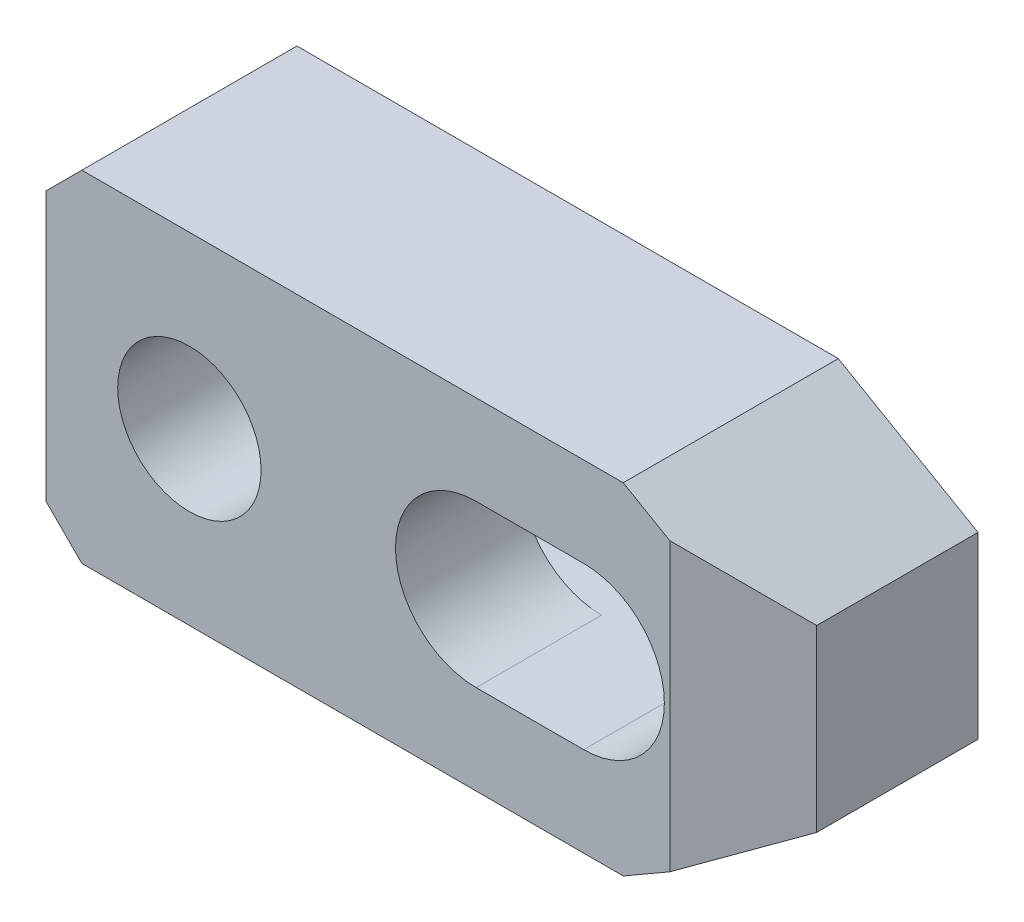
ISO-10303-21;
HEADER;
FILE_DESCRIPTION(('STEP AP214'),'2;1');
FILE_NAME('part.step','',(''),(''),'','','');
FILE_SCHEMA(('AUTOMOTIVE_DESIGN { 1 0 10303 214 1 1 1 1 }'));
ENDSEC;
DATA;
#1=APPLICATION_CONTEXT('core data for automotive mechanical design processes');
#2=APPLICATION_PROTOCOL_DEFINITION('international standard','automotive_design',2000,#1);
#3=PRODUCT_CONTEXT('',#1,'mechanical');
#4=PRODUCT('Part','Part','',(#3));
#5=PRODUCT_RELATED_PRODUCT_CATEGORY('part','',(#4));
#6=PRODUCT_DEFINITION_FORMATION('','',#4);
#7=PRODUCT_DEFINITION_CONTEXT('part definition',#1,'design');
#8=PRODUCT_DEFINITION('design','',#6,#7);
#9=PRODUCT_DEFINITION_SHAPE('','',#8);
#10=(LENGTH_UNIT() NAMED_UNIT(*) SI_UNIT(.MILLI.,.METRE.));
#11=(NAMED_UNIT(*) PLANE_ANGLE_UNIT() SI_UNIT($,.RADIAN.));
#12=(NAMED_UNIT(*) SI_UNIT($,.STERADIAN.) SOLID_ANGLE_UNIT());
#13=UNCERTAINTY_MEASURE_WITH_UNIT(LENGTH_MEASURE(1.E-05),#10,'distance_accuracy_value','');
#14=(GEOMETRIC_REPRESENTATION_CONTEXT(3) GLOBAL_UNCERTAINTY_ASSIGNED_CONTEXT((#13)) GLOBAL_UNIT_ASSIGNED_CONTEXT((#10,
#11,#12)) REPRESENTATION_CONTEXT('',''));
#15=CARTESIAN_POINT('',(0.,0.,0.));
#16=DIRECTION('',(0.,0.,1.));
#17=DIRECTION('',(1.,0.,0.));
#18=AXIS2_PLACEMENT_3D('',#15,#16,#17);
#19=CARTESIAN_POINT('',(-16.9439203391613,20.5560796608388,0.));
#20=DIRECTION('',(0.,0.,1.));
#21=DIRECTION('',(-1.,0.,0.));
#22=AXIS2_PLACEMENT_3D('',#19,#20,#21);
#23=PLANE('',#22);
#24=DIRECTION('',(0.,1.,0.));
#25=VECTOR('',#24,1.);
#26=CARTESIAN_POINT('',(-30.,-7.5,0.));
#27=LINE('',#26,#25);
#28=CARTESIAN_POINT('',(-30.,-7.5,0.));
#29=VERTEX_POINT('',#28);
#30=CARTESIAN_POINT('',(-30.,-4.5,0.));
#31=VERTEX_POINT('',#30);
#32=EDGE_CURVE('E147',#29,#31,#27,.T.);
#33=ORIENTED_EDGE('',*,*,#32,.T.);
#34=DIRECTION('',(-1.,0.,0.));
#35=VECTOR('',#34,1.);
#36=CARTESIAN_POINT('',(0.,-4.5,0.));
#37=LINE('',#36,#35);
#38=CARTESIAN_POINT('',(0.,-4.5,0.));
#39=VERTEX_POINT('',#38);
#40=EDGE_CURVE('E237',#39,#31,#37,.T.);
#41=ORIENTED_EDGE('',*,*,#40,.F.);
#42=CARTESIAN_POINT('',(0.,0.,0.));
#43=DIRECTION('',(0.,0.,1.));
#44=DIRECTION('',(-1.,0.,0.));
#45=AXIS2_PLACEMENT_3D('',#42,#43,#44);
#46=CIRCLE('',#45,4.5);
#47=CARTESIAN_POINT('',(0.,4.5,0.));
#48=VERTEX_POINT('',#47);
#49=EDGE_CURVE('E129',#39,#48,#46,.T.);
#50=ORIENTED_EDGE('',*,*,#49,.T.);
#51=DIRECTION('',(1.,0.,0.));
#52=VECTOR('',#51,1.);
#53=CARTESIAN_POINT('',(-6.,4.5,0.));
#54=LINE('',#53,#52);
#55=CARTESIAN_POINT('',(-30.,4.5,0.));
#56=VERTEX_POINT('',#55);
#57=EDGE_CURVE('E120',#56,#48,#54,.T.);
#58=ORIENTED_EDGE('',*,*,#57,.F.);
#59=CARTESIAN_POINT('',(-30.,7.5,0.));
#60=VERTEX_POINT('',#59);
#61=EDGE_CURVE('E125',#56,#60,#27,.T.);
#62=ORIENTED_EDGE('',*,*,#61,.T.);
#63=DIRECTION('',(-0.707106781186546,-0.70710678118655,0.));
#64=VECTOR('',#63,1.);
#65=CARTESIAN_POINT('',(-28.,9.5,0.));
#66=LINE('',#65,#64);
#67=CARTESIAN_POINT('',(-28.,9.5,0.));
#68=VERTEX_POINT('',#67);
#69=EDGE_CURVE('E148',#68,#60,#66,.T.);
#70=ORIENTED_EDGE('',*,*,#69,.F.);
#71=DIRECTION('',(-1.,0.,0.));
#72=VECTOR('',#71,1.);
#73=CARTESIAN_POINT('',(2.20577136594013,9.5,0.));
#74=LINE('',#73,#72);
#75=CARTESIAN_POINT('',(2.20577136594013,9.5,0.));
#76=VERTEX_POINT('',#75);
#77=EDGE_CURVE('E151',#76,#68,#74,.T.);
#78=ORIENTED_EDGE('',*,*,#77,.F.);
#79=DIRECTION('',(-0.866025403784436,0.5,0.));
#80=VECTOR('',#79,1.);
#81=CARTESIAN_POINT('',(10.,5.,0.));
#82=LINE('',#81,#80);
#83=CARTESIAN_POINT('',(10.,5.,0.));
#84=VERTEX_POINT('',#83);
#85=EDGE_CURVE('E158',#84,#76,#82,.T.);
#86=ORIENTED_EDGE('',*,*,#85,.F.);
#87=DIRECTION('',(0.,-1.,0.));
#88=VECTOR('',#87,1.);
#89=CARTESIAN_POINT('',(10.,5.,0.));
#90=LINE('',#89,#88);
#91=CARTESIAN_POINT('',(10.,-5.,0.));
#92=VERTEX_POINT('',#91);
#93=EDGE_CURVE('E181',#84,#92,#90,.T.);
#94=ORIENTED_EDGE('',*,*,#93,.T.);
#95=DIRECTION('',(-0.86602540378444,-0.5,0.));
#96=VECTOR('',#95,1.);
#97=CARTESIAN_POINT('',(10.,-5.,0.));
#98=LINE('',#97,#96);
#99=CARTESIAN_POINT('',(2.20577136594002,-9.5,0.));
#100=VERTEX_POINT('',#99);
#101=EDGE_CURVE('E208',#92,#100,#98,.T.);
#102=ORIENTED_EDGE('',*,*,#101,.T.);
#103=DIRECTION('',(-1.,0.,0.));
#104=VECTOR('',#103,1.);
#105=CARTESIAN_POINT('',(2.20577136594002,-9.5,0.));
#106=LINE('',#105,#104);
#107=CARTESIAN_POINT('',(-28.,-9.5,0.));
#108=VERTEX_POINT('',#107);
#109=EDGE_CURVE('E210',#100,#108,#106,.T.);
#110=ORIENTED_EDGE('',*,*,#109,.T.);
#111=DIRECTION('',(-0.707106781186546,0.707106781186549,0.));
#112=VECTOR('',#111,1.);
#113=CARTESIAN_POINT('',(-28.,-9.5,0.));
#114=LINE('',#113,#112);
#115=EDGE_CURVE('E150',#108,#29,#114,.T.);
#116=ORIENTED_EDGE('',*,*,#115,.T.);
#117=EDGE_LOOP('',(#33,#41,#50,#58,#62,#70,#78,#86,#94,#102,#110,#116));
#118=FACE_BOUND('',#117,.T.);
#119=ADVANCED_FACE('F14',(#118),#23,.F.);
#120=CARTESIAN_POINT('',(-30.,-7.5,12.));
#121=DIRECTION('',(-1.,0.,0.));
#122=DIRECTION('',(0.,0.,-1.));
#123=AXIS2_PLACEMENT_3D('',#120,#121,#122);
#124=PLANE('',#123);
#125=DIRECTION('',(0.,-1.,0.));
#126=VECTOR('',#125,1.);
#127=CARTESIAN_POINT('',(-30.,-7.5,5.));
#128=LINE('',#127,#126);
#129=CARTESIAN_POINT('',(-30.,4.5,5.));
#130=VERTEX_POINT('',#129);
#131=CARTESIAN_POINT('',(-30.,-4.5,5.));
#132=VERTEX_POINT('',#131);
#133=EDGE_CURVE('E141',#130,#132,#128,.T.);
#134=ORIENTED_EDGE('',*,*,#133,.T.);
#135=DIRECTION('',(0.,0.,-1.));
#136=VECTOR('',#135,1.);
#137=CARTESIAN_POINT('',(-30.,-4.5,12.));
#138=LINE('',#137,#136);
#139=EDGE_CURVE('E140',#132,#31,#138,.T.);
#140=ORIENTED_EDGE('',*,*,#139,.T.);
#141=ORIENTED_EDGE('',*,*,#32,.F.);
#142=DIRECTION('',(0.,0.,-1.));
#143=VECTOR('',#142,1.);
#144=CARTESIAN_POINT('',(-30.,-7.5,12.));
#145=LINE('',#144,#143);
#146=CARTESIAN_POINT('',(-30.,-7.5,12.));
#147=VERTEX_POINT('',#146);
#148=EDGE_CURVE('E189',#147,#29,#145,.T.);
#149=ORIENTED_EDGE('',*,*,#148,.F.);
#150=DIRECTION('',(0.,1.,0.));
#151=VECTOR('',#150,1.);
#152=CARTESIAN_POINT('',(-30.,-7.5,12.));
#153=LINE('',#152,#151);
#154=CARTESIAN_POINT('',(-30.,7.5,12.));
#155=VERTEX_POINT('',#154);
#156=EDGE_CURVE('E171',#147,#155,#153,.T.);
#157=ORIENTED_EDGE('',*,*,#156,.T.);
#158=DIRECTION('',(0.,0.,-1.));
#159=VECTOR('',#158,1.);
#160=CARTESIAN_POINT('',(-30.,7.5,12.));
#161=LINE('',#160,#159);
#162=EDGE_CURVE('E145',#155,#60,#161,.T.);
#163=ORIENTED_EDGE('',*,*,#162,.T.);
#164=ORIENTED_EDGE('',*,*,#61,.F.);
#165=DIRECTION('',(0.,0.,-1.));
#166=VECTOR('',#165,1.);
#167=CARTESIAN_POINT('',(-30.,4.5,12.));
#168=LINE('',#167,#166);
#169=EDGE_CURVE('E135',#130,#56,#168,.T.);
#170=ORIENTED_EDGE('',*,*,#169,.F.);
#171=EDGE_LOOP('',(#134,#140,#141,#149,#157,#163,#164,#170));
#172=FACE_BOUND('',#171,.T.);
#173=ADVANCED_FACE('F143',(#172),#124,.T.);
#174=CARTESIAN_POINT('',(-22.,0.,12.));
#175=DIRECTION('',(0.,0.,-1.));
#176=DIRECTION('',(1.,0.,0.));
#177=AXIS2_PLACEMENT_3D('',#174,#175,#176);
#178=CYLINDRICAL_SURFACE('',#177,4.);
#179=CARTESIAN_POINT('',(-22.,0.,12.));
#180=DIRECTION('',(0.,0.,1.));
#181=DIRECTION('',(-1.,0.,0.));
#182=AXIS2_PLACEMENT_3D('',#179,#180,#181);
#183=CIRCLE('',#182,4.);
#184=CARTESIAN_POINT('',(-26.,0.,12.));
#185=VERTEX_POINT('',#184);
#186=EDGE_CURVE('E161',#185,#185,#183,.T.);
#187=ORIENTED_EDGE('',*,*,#186,.T.);
#188=EDGE_LOOP('',(#187));
#189=FACE_BOUND('',#188,.T.);
#190=CARTESIAN_POINT('',(-22.,0.,5.));
#191=DIRECTION('',(0.,0.,-1.));
#192=DIRECTION('',(1.,0.,0.));
#193=AXIS2_PLACEMENT_3D('',#190,#191,#192);
#194=CIRCLE('',#193,4.);
#195=CARTESIAN_POINT('',(-18.,0.,5.));
#196=VERTEX_POINT('',#195);
#197=EDGE_CURVE('E398',#196,#196,#194,.T.);
#198=ORIENTED_EDGE('',*,*,#197,.T.);
#199=EDGE_LOOP('',(#198));
#200=FACE_BOUND('',#199,.T.);
#201=ADVANCED_FACE('F262',(#189,#200),#178,.F.);
#202=CARTESIAN_POINT('',(-6.,0.,12.));
#203=DIRECTION('',(0.,0.,-1.));
#204=DIRECTION('',(1.,0.,0.));
#205=AXIS2_PLACEMENT_3D('',#202,#203,#204);
#206=CYLINDRICAL_SURFACE('',#205,4.5);
#207=DIRECTION('',(0.,0.,-1.));
#208=VECTOR('',#207,1.);
#209=CARTESIAN_POINT('',(-6.,-4.5,12.));
#210=LINE('',#209,#208);
#211=CARTESIAN_POINT('',(-6.,-4.5,12.));
#212=VERTEX_POINT('',#211);
#213=CARTESIAN_POINT('',(-6.,-4.5,5.));
#214=VERTEX_POINT('',#213);
#215=EDGE_CURVE('E256',#212,#214,#210,.T.);
#216=ORIENTED_EDGE('',*,*,#215,.T.);
#217=CARTESIAN_POINT('',(-6.,0.,5.));
#218=DIRECTION('',(0.,0.,-1.));
#219=DIRECTION('',(1.,0.,0.));
#220=AXIS2_PLACEMENT_3D('',#217,#218,#219);
#221=CIRCLE('',#220,4.5);
#222=CARTESIAN_POINT('',(-6.,4.5,5.));
#223=VERTEX_POINT('',#222);
#224=EDGE_CURVE('E278',#214,#223,#221,.T.);
#225=ORIENTED_EDGE('',*,*,#224,.T.);
#226=DIRECTION('',(0.,0.,-1.));
#227=VECTOR('',#226,1.);
#228=CARTESIAN_POINT('',(-6.,4.5,12.));
#229=LINE('',#228,#227);
#230=CARTESIAN_POINT('',(-6.,4.5,12.));
#231=VERTEX_POINT('',#230);
#232=EDGE_CURVE('E244',#231,#223,#229,.T.);
#233=ORIENTED_EDGE('',*,*,#232,.F.);
#234=CARTESIAN_POINT('',(-6.,0.,12.));
#235=DIRECTION('',(0.,0.,1.));
#236=DIRECTION('',(-1.,0.,0.));
#237=AXIS2_PLACEMENT_3D('',#234,#235,#236);
#238=CIRCLE('',#237,4.5);
#239=EDGE_CURVE('E132',#231,#212,#238,.T.);
#240=ORIENTED_EDGE('',*,*,#239,.T.);
#241=EDGE_LOOP('',(#216,#225,#233,#240));
#242=FACE_BOUND('',#241,.T.);
#243=ADVANCED_FACE('F269',(#242),#206,.F.);
#244=CARTESIAN_POINT('',(-16.9439203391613,20.5560796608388,12.));
#245=DIRECTION('',(0.,0.,1.));
#246=DIRECTION('',(-1.,0.,0.));
#247=AXIS2_PLACEMENT_3D('',#244,#245,#246);
#248=PLANE('',#247);
#249=DIRECTION('',(0.,-1.,0.));
#250=VECTOR('',#249,1.);
#251=CARTESIAN_POINT('',(4.80384757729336,20.5560796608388,12.));
#252=LINE('',#251,#250);
#253=CARTESIAN_POINT('',(4.80384757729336,8.,12.));
#254=VERTEX_POINT('',#253);
#255=CARTESIAN_POINT('',(4.80384757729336,-8.,12.));
#256=VERTEX_POINT('',#255);
#257=EDGE_CURVE('E233',#254,#256,#252,.T.);
#258=ORIENTED_EDGE('',*,*,#257,.F.);
#259=DIRECTION('',(-0.866025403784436,0.5,0.));
#260=VECTOR('',#259,1.);
#261=CARTESIAN_POINT('',(10.,5.,12.));
#262=LINE('',#261,#260);
#263=CARTESIAN_POINT('',(2.20577136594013,9.5,12.));
#264=VERTEX_POINT('',#263);
#265=EDGE_CURVE('E179',#254,#264,#262,.T.);
#266=ORIENTED_EDGE('',*,*,#265,.T.);
#267=DIRECTION('',(-1.,0.,0.));
#268=VECTOR('',#267,1.);
#269=CARTESIAN_POINT('',(2.20577136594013,9.5,12.));
#270=LINE('',#269,#268);
#271=CARTESIAN_POINT('',(-28.,9.5,12.));
#272=VERTEX_POINT('',#271);
#273=EDGE_CURVE('E176',#264,#272,#270,.T.);
#274=ORIENTED_EDGE('',*,*,#273,.T.);
#275=DIRECTION('',(-0.707106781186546,-0.70710678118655,0.));
#276=VECTOR('',#275,1.);
#277=CARTESIAN_POINT('',(-28.,9.5,12.));
#278=LINE('',#277,#276);
#279=EDGE_CURVE('E173',#272,#155,#278,.T.);
#280=ORIENTED_EDGE('',*,*,#279,.T.);
#281=ORIENTED_EDGE('',*,*,#156,.F.);
#282=DIRECTION('',(-0.707106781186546,0.707106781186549,0.));
#283=VECTOR('',#282,1.);
#284=CARTESIAN_POINT('',(-28.,-9.5,12.));
#285=LINE('',#284,#283);
#286=CARTESIAN_POINT('',(-28.,-9.5,12.));
#287=VERTEX_POINT('',#286);
#288=EDGE_CURVE('E168',#287,#147,#285,.T.);
#289=ORIENTED_EDGE('',*,*,#288,.F.);
#290=DIRECTION('',(-1.,0.,0.));
#291=VECTOR('',#290,1.);
#292=CARTESIAN_POINT('',(2.20577136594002,-9.5,12.));
#293=LINE('',#292,#291);
#294=CARTESIAN_POINT('',(2.20577136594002,-9.5,12.));
#295=VERTEX_POINT('',#294);
#296=EDGE_CURVE('E165',#295,#287,#293,.T.);
#297=ORIENTED_EDGE('',*,*,#296,.F.);
#298=DIRECTION('',(-0.86602540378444,-0.5,0.));
#299=VECTOR('',#298,1.);
#300=CARTESIAN_POINT('',(10.,-5.,12.));
#301=LINE('',#300,#299);
#302=EDGE_CURVE('E162',#256,#295,#301,.T.);
#303=ORIENTED_EDGE('',*,*,#302,.F.);
#304=EDGE_LOOP('',(#258,#266,#274,#280,#281,#289,#297,#303));
#305=FACE_BOUND('',#304,.T.);
#306=ORIENTED_EDGE('',*,*,#186,.F.);
#307=EDGE_LOOP('',(#306));
#308=FACE_BOUND('',#307,.T.);
#309=DIRECTION('',(-1.,0.,0.));
#310=VECTOR('',#309,1.);
#311=CARTESIAN_POINT('',(0.,-4.5,12.));
#312=LINE('',#311,#310);
#313=CARTESIAN_POINT('',(0.,-4.5,12.));
#314=VERTEX_POINT('',#313);
#315=EDGE_CURVE('E247',#314,#212,#312,.T.);
#316=ORIENTED_EDGE('',*,*,#315,.T.);
#317=ORIENTED_EDGE('',*,*,#239,.F.);
#318=DIRECTION('',(1.,0.,0.));
#319=VECTOR('',#318,1.);
#320=CARTESIAN_POINT('',(-6.,4.5,12.));
#321=LINE('',#320,#319);
#322=CARTESIAN_POINT('',(0.,4.5,12.));
#323=VERTEX_POINT('',#322);
#324=EDGE_CURVE('E241',#231,#323,#321,.T.);
#325=ORIENTED_EDGE('',*,*,#324,.T.);
#326=CARTESIAN_POINT('',(0.,0.,12.));
#327=DIRECTION('',(0.,0.,1.));
#328=DIRECTION('',(-1.,0.,0.));
#329=AXIS2_PLACEMENT_3D('',#326,#327,#328);
#330=CIRCLE('',#329,4.5);
#331=EDGE_CURVE('E245',#314,#323,#330,.T.);
#332=ORIENTED_EDGE('',*,*,#331,.F.);
#333=EDGE_LOOP('',(#316,#317,#325,#332));
#334=FACE_BOUND('',#333,.T.);
#335=ADVANCED_FACE('F265',(#305,#308,#334),#248,.T.);
#336=CARTESIAN_POINT('',(10.,5.,12.));
#337=DIRECTION('',(-0.5,-0.866025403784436,0.));
#338=DIRECTION('',(0.866025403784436,-0.5,0.));
#339=AXIS2_PLACEMENT_3D('',#336,#337,#338);
#340=PLANE('',#339);
#341=ORIENTED_EDGE('',*,*,#265,.F.);
#342=DIRECTION('',(0.774596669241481,-0.447213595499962,-0.447213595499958));
#343=VECTOR('',#342,1.);
#344=CARTESIAN_POINT('',(8.96076951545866,5.6,9.6));
#345=LINE('',#344,#343);
#346=CARTESIAN_POINT('',(10.,5.,9.));
#347=VERTEX_POINT('',#346);
#348=EDGE_CURVE('E235',#254,#347,#345,.T.);
#349=ORIENTED_EDGE('',*,*,#348,.T.);
#350=DIRECTION('',(0.,0.,-1.));
#351=VECTOR('',#350,1.);
#352=CARTESIAN_POINT('',(10.,5.,12.));
#353=LINE('',#352,#351);
#354=EDGE_CURVE('E164',#347,#84,#353,.T.);
#355=ORIENTED_EDGE('',*,*,#354,.T.);
#356=ORIENTED_EDGE('',*,*,#85,.T.);
#357=DIRECTION('',(0.,0.,-1.));
#358=VECTOR('',#357,1.);
#359=CARTESIAN_POINT('',(2.20577136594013,9.5,12.));
#360=LINE('',#359,#358);
#361=EDGE_CURVE('E9',#264,#76,#360,.T.);
#362=ORIENTED_EDGE('',*,*,#361,.F.);
#363=EDGE_LOOP('',(#341,#349,#355,#356,#362));
#364=FACE_BOUND('',#363,.T.);
#365=ADVANCED_FACE('F268',(#364),#340,.F.);
#366=CARTESIAN_POINT('',(2.20577136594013,9.5,12.));
#367=DIRECTION('',(0.,-1.,0.));
#368=DIRECTION('',(1.,0.,0.));
#369=AXIS2_PLACEMENT_3D('',#366,#367,#368);
#370=PLANE('',#369);
#371=DIRECTION('',(0.,0.,-1.));
#372=VECTOR('',#371,1.);
#373=CARTESIAN_POINT('',(-28.,9.5,12.));
#374=LINE('',#373,#372);
#375=EDGE_CURVE('E22',#272,#68,#374,.T.);
#376=ORIENTED_EDGE('',*,*,#375,.F.);
#377=ORIENTED_EDGE('',*,*,#273,.F.);
#378=ORIENTED_EDGE('',*,*,#361,.T.);
#379=ORIENTED_EDGE('',*,*,#77,.T.);
#380=EDGE_LOOP('',(#376,#377,#378,#379));
#381=FACE_BOUND('',#380,.T.);
#382=ADVANCED_FACE('F16',(#381),#370,.F.);
#383=CARTESIAN_POINT('',(-28.,9.5,12.));
#384=DIRECTION('',(0.70710678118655,-0.707106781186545,0.));
#385=DIRECTION('',(0.707106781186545,0.70710678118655,0.));
#386=AXIS2_PLACEMENT_3D('',#383,#384,#385);
#387=PLANE('',#386);
#388=ORIENTED_EDGE('',*,*,#162,.F.);
#389=ORIENTED_EDGE('',*,*,#279,.F.);
#390=ORIENTED_EDGE('',*,*,#375,.T.);
#391=ORIENTED_EDGE('',*,*,#69,.T.);
#392=EDGE_LOOP('',(#388,#389,#390,#391));
#393=FACE_BOUND('',#392,.T.);
#394=ADVANCED_FACE('F193',(#393),#387,.F.);
#395=CARTESIAN_POINT('',(-28.,-9.5,12.));
#396=DIRECTION('',(-0.707106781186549,-0.707106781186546,0.));
#397=DIRECTION('',(0.707106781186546,-0.707106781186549,0.));
#398=AXIS2_PLACEMENT_3D('',#395,#396,#397);
#399=PLANE('',#398);
#400=DIRECTION('',(0.,0.,-1.));
#401=VECTOR('',#400,1.);
#402=CARTESIAN_POINT('',(-28.,-9.5,12.));
#403=LINE('',#402,#401);
#404=EDGE_CURVE('E187',#287,#108,#403,.T.);
#405=ORIENTED_EDGE('',*,*,#404,.F.);
#406=ORIENTED_EDGE('',*,*,#288,.T.);
#407=ORIENTED_EDGE('',*,*,#148,.T.);
#408=ORIENTED_EDGE('',*,*,#115,.F.);
#409=EDGE_LOOP('',(#405,#406,#407,#408));
#410=FACE_BOUND('',#409,.T.);
#411=ADVANCED_FACE('F220',(#410),#399,.T.);
#412=CARTESIAN_POINT('',(2.20577136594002,-9.5,12.));
#413=DIRECTION('',(0.,-1.,0.));
#414=DIRECTION('',(1.,0.,0.));
#415=AXIS2_PLACEMENT_3D('',#412,#413,#414);
#416=PLANE('',#415);
#417=DIRECTION('',(0.,0.,-1.));
#418=VECTOR('',#417,1.);
#419=CARTESIAN_POINT('',(2.20577136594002,-9.5,12.));
#420=LINE('',#419,#418);
#421=EDGE_CURVE('E185',#295,#100,#420,.T.);
#422=ORIENTED_EDGE('',*,*,#421,.F.);
#423=ORIENTED_EDGE('',*,*,#296,.T.);
#424=ORIENTED_EDGE('',*,*,#404,.T.);
#425=ORIENTED_EDGE('',*,*,#109,.F.);
#426=EDGE_LOOP('',(#422,#423,#424,#425));
#427=FACE_BOUND('',#426,.T.);
#428=ADVANCED_FACE('F306',(#427),#416,.T.);
#429=CARTESIAN_POINT('',(10.,-5.,12.));
#430=DIRECTION('',(0.5,-0.86602540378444,0.));
#431=DIRECTION('',(0.86602540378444,0.5,0.));
#432=AXIS2_PLACEMENT_3D('',#429,#430,#431);
#433=PLANE('',#432);
#434=DIRECTION('',(0.774596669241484,0.447213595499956,-0.44721359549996));
#435=VECTOR('',#434,1.);
#436=CARTESIAN_POINT('',(8.96076951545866,-5.6,9.6));
#437=LINE('',#436,#435);
#438=CARTESIAN_POINT('',(10.,-5.,9.));
#439=VERTEX_POINT('',#438);
#440=EDGE_CURVE('E37',#256,#439,#437,.T.);
#441=ORIENTED_EDGE('',*,*,#440,.F.);
#442=ORIENTED_EDGE('',*,*,#302,.T.);
#443=ORIENTED_EDGE('',*,*,#421,.T.);
#444=ORIENTED_EDGE('',*,*,#101,.F.);
#445=DIRECTION('',(0.,0.,-1.));
#446=VECTOR('',#445,1.);
#447=CARTESIAN_POINT('',(10.,-5.,12.));
#448=LINE('',#447,#446);
#449=EDGE_CURVE('E183',#439,#92,#448,.T.);
#450=ORIENTED_EDGE('',*,*,#449,.F.);
#451=EDGE_LOOP('',(#441,#442,#443,#444,#450));
#452=FACE_BOUND('',#451,.T.);
#453=ADVANCED_FACE('F303',(#452),#433,.T.);
#454=CARTESIAN_POINT('',(10.,5.,12.));
#455=DIRECTION('',(1.,0.,0.));
#456=DIRECTION('',(0.,0.,1.));
#457=AXIS2_PLACEMENT_3D('',#454,#455,#456);
#458=PLANE('',#457);
#459=DIRECTION('',(0.,-1.,0.));
#460=VECTOR('',#459,1.);
#461=CARTESIAN_POINT('',(10.,20.,9.));
#462=LINE('',#461,#460);
#463=EDGE_CURVE('E227',#347,#439,#462,.T.);
#464=ORIENTED_EDGE('',*,*,#463,.T.);
#465=ORIENTED_EDGE('',*,*,#449,.T.);
#466=ORIENTED_EDGE('',*,*,#93,.F.);
#467=ORIENTED_EDGE('',*,*,#354,.F.);
#468=EDGE_LOOP('',(#464,#465,#466,#467));
#469=FACE_BOUND('',#468,.T.);
#470=ADVANCED_FACE('F205',(#469),#458,.T.);
#471=CARTESIAN_POINT('',(0.,-4.5,12.));
#472=DIRECTION('',(0.,-1.,0.));
#473=DIRECTION('',(1.,0.,0.));
#474=AXIS2_PLACEMENT_3D('',#471,#472,#473);
#475=PLANE('',#474);
#476=ORIENTED_EDGE('',*,*,#40,.T.);
#477=ORIENTED_EDGE('',*,*,#139,.F.);
#478=DIRECTION('',(1.,0.,0.));
#479=VECTOR('',#478,1.);
#480=CARTESIAN_POINT('',(-60.,-4.5,5.));
#481=LINE('',#480,#479);
#482=EDGE_CURVE('E276',#132,#214,#481,.T.);
#483=ORIENTED_EDGE('',*,*,#482,.T.);
#484=ORIENTED_EDGE('',*,*,#215,.F.);
#485=ORIENTED_EDGE('',*,*,#315,.F.);
#486=DIRECTION('',(0.,0.,-1.));
#487=VECTOR('',#486,1.);
#488=CARTESIAN_POINT('',(0.,-4.5,12.));
#489=LINE('',#488,#487);
#490=EDGE_CURVE('E255',#314,#39,#489,.T.);
#491=ORIENTED_EDGE('',*,*,#490,.T.);
#492=EDGE_LOOP('',(#476,#477,#483,#484,#485,#491));
#493=FACE_BOUND('',#492,.T.);
#494=ADVANCED_FACE('F275',(#493),#475,.F.);
#495=CARTESIAN_POINT('',(0.,0.,12.));
#496=DIRECTION('',(0.,0.,-1.));
#497=DIRECTION('',(1.,0.,0.));
#498=AXIS2_PLACEMENT_3D('',#495,#496,#497);
#499=CYLINDRICAL_SURFACE('',#498,4.5);
#500=DIRECTION('',(0.,0.,-1.));
#501=VECTOR('',#500,1.);
#502=CARTESIAN_POINT('',(0.,4.5,12.));
#503=LINE('',#502,#501);
#504=EDGE_CURVE('E253',#323,#48,#503,.T.);
#505=ORIENTED_EDGE('',*,*,#504,.T.);
#506=ORIENTED_EDGE('',*,*,#49,.F.);
#507=ORIENTED_EDGE('',*,*,#490,.F.);
#508=ORIENTED_EDGE('',*,*,#331,.T.);
#509=EDGE_LOOP('',(#505,#506,#507,#508));
#510=FACE_BOUND('',#509,.T.);
#511=ADVANCED_FACE('F280',(#510),#499,.F.);
#512=CARTESIAN_POINT('',(-6.,4.5,12.));
#513=DIRECTION('',(0.,1.,0.));
#514=DIRECTION('',(-1.,0.,0.));
#515=AXIS2_PLACEMENT_3D('',#512,#513,#514);
#516=PLANE('',#515);
#517=ORIENTED_EDGE('',*,*,#57,.T.);
#518=ORIENTED_EDGE('',*,*,#504,.F.);
#519=ORIENTED_EDGE('',*,*,#324,.F.);
#520=ORIENTED_EDGE('',*,*,#232,.T.);
#521=DIRECTION('',(1.,0.,0.));
#522=VECTOR('',#521,1.);
#523=CARTESIAN_POINT('',(-60.,4.5,5.));
#524=LINE('',#523,#522);
#525=EDGE_CURVE('E29',#130,#223,#524,.T.);
#526=ORIENTED_EDGE('',*,*,#525,.F.);
#527=ORIENTED_EDGE('',*,*,#169,.T.);
#528=EDGE_LOOP('',(#517,#518,#519,#520,#526,#527));
#529=FACE_BOUND('',#528,.T.);
#530=ADVANCED_FACE('F136',(#529),#516,.F.);
#531=CARTESIAN_POINT('',(-2.124355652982,20.,16.));
#532=DIRECTION('',(-0.5,0.,-0.866025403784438));
#533=DIRECTION('',(0.866025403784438,0.,-0.5));
#534=AXIS2_PLACEMENT_3D('',#531,#532,#533);
#535=PLANE('',#534);
#536=ORIENTED_EDGE('',*,*,#257,.T.);
#537=ORIENTED_EDGE('',*,*,#440,.T.);
#538=ORIENTED_EDGE('',*,*,#463,.F.);
#539=ORIENTED_EDGE('',*,*,#348,.F.);
#540=EDGE_LOOP('',(#536,#537,#538,#539));
#541=FACE_BOUND('',#540,.T.);
#542=ADVANCED_FACE('F288',(#541),#535,.F.);
#543=CARTESIAN_POINT('',(-60.,-4.5,5.));
#544=DIRECTION('',(0.,0.,-1.));
#545=DIRECTION('',(1.,0.,0.));
#546=AXIS2_PLACEMENT_3D('',#543,#544,#545);
#547=PLANE('',#546);
#548=ORIENTED_EDGE('',*,*,#197,.F.);
#549=EDGE_LOOP('',(#548));
#550=FACE_BOUND('',#549,.T.);
#551=ORIENTED_EDGE('',*,*,#525,.T.);
#552=ORIENTED_EDGE('',*,*,#224,.F.);
#553=ORIENTED_EDGE('',*,*,#482,.F.);
#554=ORIENTED_EDGE('',*,*,#133,.F.);
#555=EDGE_LOOP('',(#551,#552,#553,#554));
#556=FACE_BOUND('',#555,.T.);
#557=ADVANCED_FACE('F384',(#550,#556),#547,.T.);
#558=CLOSED_SHELL('',(#119,#173,#201,#243,#335,#365,#382,#394,#411,#428,#453,#470,#494,#511,
#530,#542,#557));
#559=MANIFOLD_SOLID_BREP('B1',#558);
#560=ADVANCED_BREP_SHAPE_REPRESENTATION('',(#18,#559),#14);
#561=SHAPE_DEFINITION_REPRESENTATION(#9,#560);
ENDSEC;
END-ISO-10303-21;
